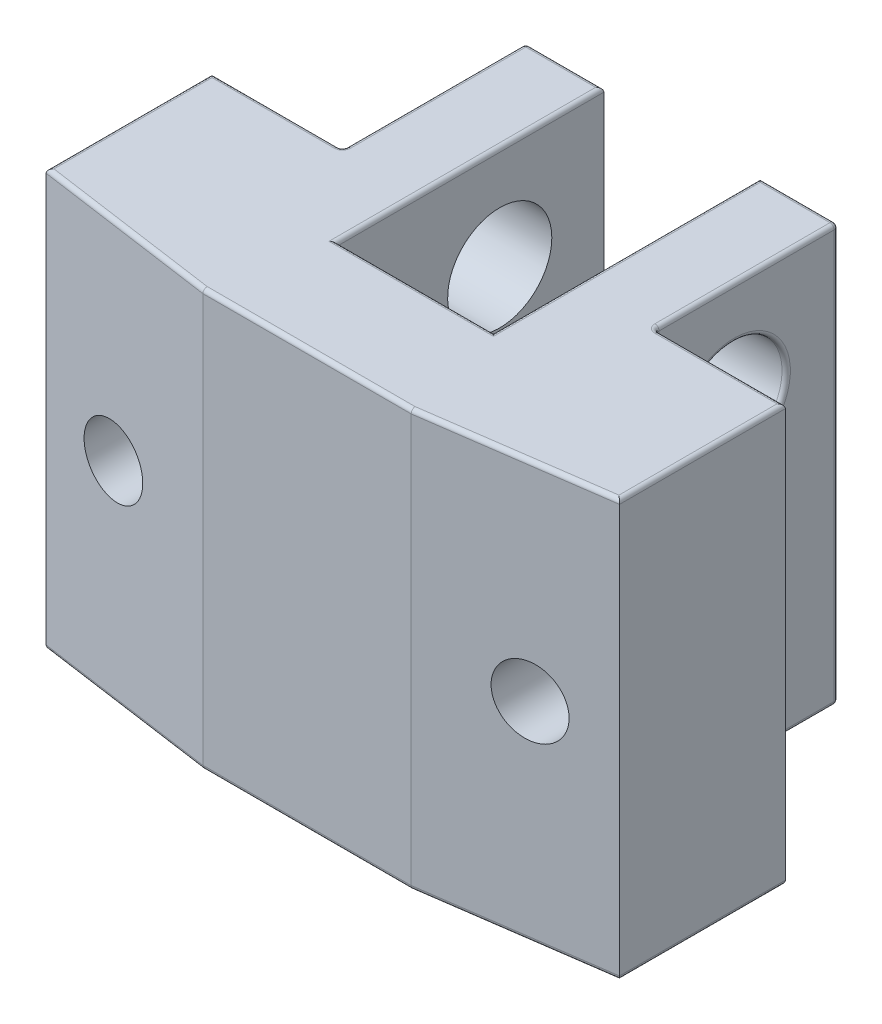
from build123d import *

# Parameters (mm, degrees)
SKETCH1_W              = 34.9504
SKETCH1_H              = 25.4
BASE_EXTRUDE_DEPTH     = 22.86
SKETCH3_R              = 2.0828
CUT_EXTRUDE_8_32_DEPTH = 12.7
SKETCH5_R              = 3.175
CUT_EXTRUDE1_DEPTH     = 46.902206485
CUT_EXTRUDE2_DEPTH     = 16.256
CUT_EXTRUDE3_DEPTH     = 39.381274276
SKETCH8_W              = 7.9502
SKETCH8_H              = 11.176
CUT_EXTRUDE4_DEPTH     = 39.381274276
FILLET1_R              = 0.254


with BuildPart() as part:
    # Sketch1 → Base-Extrude (new body)
    with BuildSketch(Plane.XY):
        with Locations((0, -6.35)):
            Rectangle(SKETCH1_W, SKETCH1_H)
    extrude(amount=BASE_EXTRUDE_DEPTH)

    # Sketch3 → Cut-Extrude 8-32 (cut)
    with BuildSketch(Plane(origin=(0, 0, 22.86), x_dir=(-1, 0, 0), z_dir=(0, 0, -1))):
        with Locations(Location((12.7, -6.35, 0), (0, 0, 180))):
            Circle(SKETCH3_R)
        with Locations(Location((-12.7, -6.35, 0), (0, 0, 180))):
            Circle(SKETCH3_R)
    extrude(amount=CUT_EXTRUDE_8_32_DEPTH, mode=Mode.SUBTRACT)

    # Sketch5 → Cut-Extrude1 (cut, through all)
    with BuildSketch(Plane.ZY.offset(17.4752)):
        with Locations((6.35, 0)):
            Circle(SKETCH5_R)
    extrude(amount=-CUT_EXTRUDE1_DEPTH, mode=Mode.SUBTRACT)

    # Sketch6 → Cut-Extrude2 (cut)
    with BuildSketch(Plane.XY):
        with BuildLine():
            Line((-4.7625, -5.2832), (-4.7625, 6.35))
            Line((-4.7625, 6.35), (4.7625, 6.35))
            Line((4.7625, 6.35), (4.7625, -5.2832))
            ThreePointArc((4.7625, -5.2832), (0, -10.0457), (-4.7625, -5.2832))
        make_face()
    extrude(amount=CUT_EXTRUDE2_DEPTH, mode=Mode.SUBTRACT)

    # Sketch7 → Cut-Extrude3 (cut, through all)
    with BuildSketch(Plane(origin=(0, 6.35, 0), x_dir=(-1, 0, 0), z_dir=(0, 1, 0))):
        Polygon((-17.4752, 21.2852), (-6.35, 22.86), (-17.4752, 22.86), align=None)
        Polygon((17.4752, 22.86), (17.4752, 21.2852), (6.35, 22.86), align=None)
    extrude(amount=-CUT_EXTRUDE3_DEPTH, mode=Mode.SUBTRACT)

    # Sketch8 → Cut-Extrude4 (cut, through all)
    with BuildSketch(Plane.XZ.offset(19.05)):
        with Locations((13.5001, 5.588)):
            Rectangle(SKETCH8_W, SKETCH8_H)
        with Locations((-13.5001, 5.588)):
            Rectangle(SKETCH8_W, SKETCH8_H)
    extrude(amount=-CUT_EXTRUDE4_DEPTH, mode=Mode.SUBTRACT)

    # Fillet1
    fillet1_edges = [part.edges().sort_by_distance(p)[0] for p in [
        (7.14375, 6.35, 0),
        (4.7625, 6.35, 8.128),
        (0, 6.35, 16.256),
        (-4.7625, 6.35, 8.128),
        (-7.14375, 6.35, 0),
        (-9.525, 6.35, 5.588),
        (-13.5001, 6.35, 11.176),
        (-17.4752, 6.35, 16.2306),
        (-11.9126, 6.35, 22.0726),
        (0, 6.35, 22.86),
        (11.9126, 6.35, 22.0726),
        (17.4752, 6.35, 16.2306),
        (13.5001, 6.35, 11.176),
        (9.525, 6.35, 5.588),
        (0, -19.05, 0),
        (-9.525, -6.35, 0),
        (9.525, -6.35, 0),
        (-9.525, -19.05, 5.588),
        (-9.525, -6.35, 11.176),
        (-9.525, 0, 3.175),
        (-13.5001, -19.05, 11.176),
        (-17.4752, -19.05, 16.2306),
        (-11.9126, -19.05, 22.0726),
        (0, -19.05, 22.86),
        (11.9126, -19.05, 22.0726),
        (17.4752, -19.05, 16.2306),
        (13.5001, -19.05, 11.176),
        (9.525, -6.35, 11.176),
        (9.525, -19.05, 5.588),
        (9.525, 0, 3.175),
    ]]
    fillet(fillet1_edges, radius=FILLET1_R)


solid = part.part
